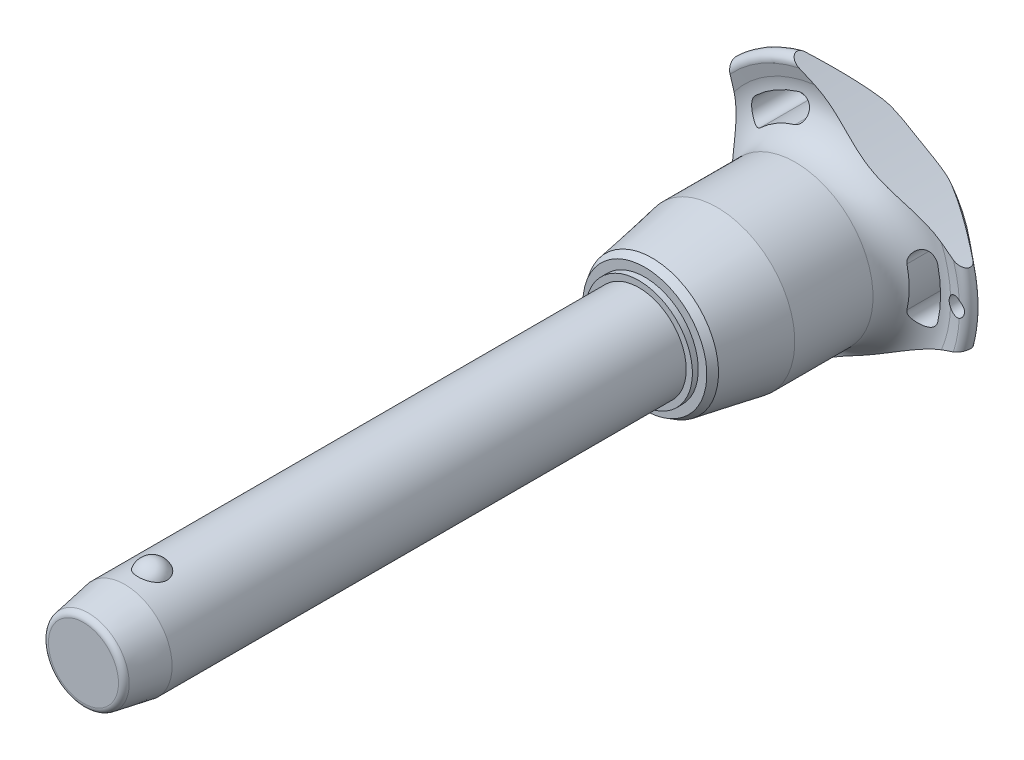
from build123d import *

# Parameters (mm, degrees)
SKETCH1_R           = 8
BOSS_EXTRUDE1_DEPTH = 80
SKETCH2_R           = 7
BOSS_EXTRUDE2_DEPTH = 39.7
BOSS_EXTRUDE3_START = 14
SKETCH1_2_R         = 8
BOSS_EXTRUDE3_DEPTH = 14
CHAMFER1_SIZE       = 7
CHAMFER1_SIZE2      = 1.234288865
FILLET1_R           = 1
SKETCH6_R           = 144.275
CUT_EXTRUDE1_DEPTH  = 125.345019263
CIRPATTERN1_COUNT   = 3
SKETCH7_R           = 1.5
CUT_EXTRUDE2_DEPTH  = 125.183516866


with BuildPart() as part:
    # Sketch1 → Boss-Extrude1 (new body)
    with BuildSketch(Plane.XY):
        Circle(SKETCH1_R)
    extrude(amount=-BOSS_EXTRUDE1_DEPTH)

    # Sketch2 → Boss-Extrude2 (add)
    with BuildSketch(Plane(origin=(0, 0, -80), x_dir=(-1, 0, 0), z_dir=(0, 0, -1))):
        Circle(SKETCH2_R)
    extrude(amount=BOSS_EXTRUDE2_DEPTH)

    # Sketch3 → Revolve1 (revolve)
    with BuildSketch(Plane(origin=(0, 0, 0), x_dir=(0, 0, -1), z_dir=(1, 0, 0))):
        with BuildLine():
            Line((-2.387467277, 9.5), (-2.387467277, 4.2))
            ThreePointArc((-2.387467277, 4.2), (0.262532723, 6.85), (-2.387467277, 9.5))
        make_face()
        with BuildLine():
            Line((-2.387467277, -4.2), (-2.387467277, -9.5))
            ThreePointArc((-2.387467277, -9.5), (0.262532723, -6.85), (-2.387467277, -4.2))
        make_face()
    revolve(axis=Axis((0, -4.2, 2.387467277), (0, 1, 0)))

    # Sketch1_2 → Boss-Extrude3 (add)
    with BuildSketch(Plane.XY.offset(BOSS_EXTRUDE3_START)):
        Circle(SKETCH1_2_R)
    extrude(amount=-BOSS_EXTRUDE3_DEPTH)

    # Chamfer1
    chamfer1_edges = [part.edges().sort_by_distance(p)[0] for p in [
        (-8, 0, 14),
    ]]
    chamfer1_side = [part.faces().sort_by_distance(p)[0] for p in [
        (-8, 0, -33),
    ]]
    chamfer(chamfer1_edges, length=CHAMFER1_SIZE, length2=CHAMFER1_SIZE2, reference=chamfer1_side[0])

    # Fillet1
    fillet1_edges = [part.edges().sort_by_distance(p)[0] for p in [
        (-6.765711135, 0, 14),
        (7, 0, -119.7),
    ]]
    fillet(fillet1_edges, radius=FILLET1_R)

    # Sketch4 → Revolve2 (revolve)
    with BuildSketch(Plane(origin=(0, 0, 0), x_dir=(0, 0, -1), z_dir=(1, 0, 0)), mode=Mode.PRIVATE) as revolve2_sk:
        Polygon((80, 0), (80, 9.044607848), (81, 9.044607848), (81, 10.490707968), (82.25235944, 11.213758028), (93.233333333, 13.15), (106.466666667, 13.15), (106.466666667, 0), align=None)
    revolve(revolve2_sk.sketch.rotate(Axis((0, 0, -106.466666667), (0, 0, 1)), 90), axis=Axis((0, 0, -106.466666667), (0, 0, 1)))

    # Sketch5 → Revolve3 (revolve)
    with BuildSketch(Plane(origin=(0, 0, 0), x_dir=(0, 0, -1), z_dir=(1, 0, 0)), mode=Mode.PRIVATE) as revolve3_sk:
        with BuildLine():
            Line((112.32877039, 20.428960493), (111.910912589, 22.344207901))
            ThreePointArc((111.910912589, 22.344207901), (112.554394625, 23.677136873), (114.002586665, 23.371345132))
            Line((114.002586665, 23.371345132), (119.141488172, 17.247040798))
            ThreePointArc((119.141488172, 17.247040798), (119.7, 15.584758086), (118.978803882, 13.986322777))
            ThreePointArc((118.978803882, 13.986322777), (114.617427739, 7.589034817), (113.083333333, 0))
            Line((113.083333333, 0), (106.466666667, 0))
            Line((106.466666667, 0), (106.466666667, 13.15))
            ThreePointArc((106.466666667, 13.15), (111.139661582, 15.38660811), (112.32877039, 20.428960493))
        make_face()
    revolve(revolve3_sk.sketch.rotate(Axis((0, 0, -113.083333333), (0, 0, 1)), 90), axis=Axis((0, 0, -113.083333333), (0, 0, 1)))

    # Sketch6 → Cut-Extrude1 (cut, through all)
    with BuildSketch(Plane.XY):
        with Locations((-159.975, 0)):
            Circle(SKETCH6_R)
        with BuildLine():
            ThreePointArc((18.131206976, -4.190753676), (18.60922037, 0), (18.131206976, 4.190753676))
            ThreePointArc((18.131206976, 4.190753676), (15.94840906, 5.553949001), (14.585213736, 3.371151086))
            ThreePointArc((14.585213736, 3.371151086), (14.969740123, 0), (14.585213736, -3.371151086))
            ThreePointArc((14.585213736, -3.371151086), (15.94840906, -5.553949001), (18.131206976, -4.190753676))
        make_face()
    cut_extrude1 = extrude(amount=-CUT_EXTRUDE1_DEPTH, mode=Mode.SUBTRACT)

    # CirPattern1: Cut-Extrude1 ×3 about axis
    cirpattern1_axis = Axis((0, 0, 0), (0, 0, 1))
    for i in range(1, CIRPATTERN1_COUNT):
        add(cut_extrude1.rotate(cirpattern1_axis, i * 360 / CIRPATTERN1_COUNT), mode=Mode.SUBTRACT)

    # Sketch7 → Cut-Extrude2 (cut, through all)
    with BuildSketch(Plane.XY):
        with Locations(Location((21.60922037, 0, 0), (0, 0, 297.620773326))):
            Circle(SKETCH7_R)
    extrude(amount=-CUT_EXTRUDE2_DEPTH, mode=Mode.SUBTRACT)


solid = part.part
